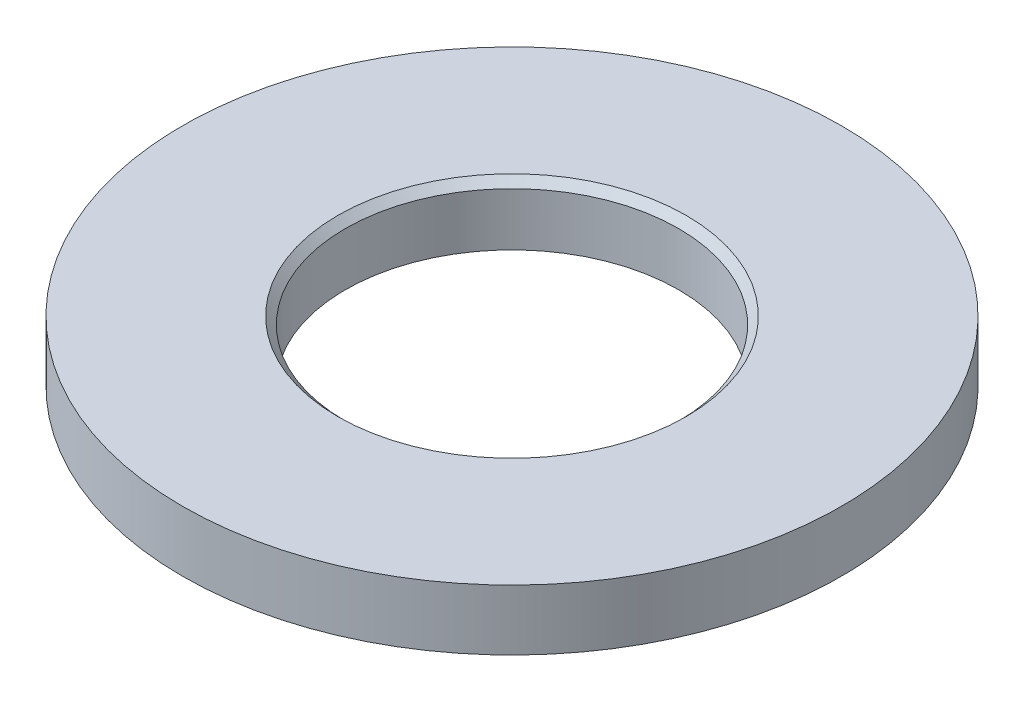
ISO-10303-21;
HEADER;
FILE_DESCRIPTION(('STEP AP214'),'2;1');
FILE_NAME('part.step','',(''),(''),'','','');
FILE_SCHEMA(('AUTOMOTIVE_DESIGN { 1 0 10303 214 1 1 1 1 }'));
ENDSEC;
DATA;
#1=APPLICATION_CONTEXT('core data for automotive mechanical design processes');
#2=APPLICATION_PROTOCOL_DEFINITION('international standard','automotive_design',2000,#1);
#3=PRODUCT_CONTEXT('',#1,'mechanical');
#4=PRODUCT('Part','Part','',(#3));
#5=PRODUCT_RELATED_PRODUCT_CATEGORY('part','',(#4));
#6=PRODUCT_DEFINITION_FORMATION('','',#4);
#7=PRODUCT_DEFINITION_CONTEXT('part definition',#1,'design');
#8=PRODUCT_DEFINITION('design','',#6,#7);
#9=PRODUCT_DEFINITION_SHAPE('','',#8);
#10=(LENGTH_UNIT() NAMED_UNIT(*) SI_UNIT(.MILLI.,.METRE.));
#11=(NAMED_UNIT(*) PLANE_ANGLE_UNIT() SI_UNIT($,.RADIAN.));
#12=(NAMED_UNIT(*) SI_UNIT($,.STERADIAN.) SOLID_ANGLE_UNIT());
#13=UNCERTAINTY_MEASURE_WITH_UNIT(LENGTH_MEASURE(1.E-05),#10,'distance_accuracy_value','');
#14=(GEOMETRIC_REPRESENTATION_CONTEXT(3) GLOBAL_UNCERTAINTY_ASSIGNED_CONTEXT((#13)) GLOBAL_UNIT_ASSIGNED_CONTEXT((#10,
#11,#12)) REPRESENTATION_CONTEXT('',''));
#15=CARTESIAN_POINT('',(0.,0.,0.));
#16=DIRECTION('',(0.,0.,1.));
#17=DIRECTION('',(1.,0.,0.));
#18=AXIS2_PLACEMENT_3D('',#15,#16,#17);
#19=CARTESIAN_POINT('',(0.,0.8,0.));
#20=DIRECTION('',(0.,1.,0.));
#21=DIRECTION('',(0.,0.,1.));
#22=AXIS2_PLACEMENT_3D('',#19,#20,#21);
#23=PLANE('',#22);
#24=CARTESIAN_POINT('',(0.,0.8,0.));
#25=DIRECTION('',(0.,1.,0.));
#26=DIRECTION('',(0.,0.,1.));
#27=AXIS2_PLACEMENT_3D('',#24,#25,#26);
#28=CIRCLE('',#27,2.3);
#29=CARTESIAN_POINT('',(0.,0.8,2.3));
#30=VERTEX_POINT('',#29);
#31=EDGE_CURVE('E10',#30,#30,#28,.F.);
#32=ORIENTED_EDGE('',*,*,#31,.T.);
#33=EDGE_LOOP('',(#32));
#34=FACE_BOUND('',#33,.T.);
#35=CARTESIAN_POINT('',(0.,0.8,0.));
#36=DIRECTION('',(0.,1.,0.));
#37=DIRECTION('',(0.,0.,1.));
#38=AXIS2_PLACEMENT_3D('',#35,#36,#37);
#39=CIRCLE('',#38,4.35);
#40=CARTESIAN_POINT('',(0.,0.8,-4.35));
#41=VERTEX_POINT('',#40);
#42=EDGE_CURVE('E40',#41,#41,#39,.T.);
#43=ORIENTED_EDGE('',*,*,#42,.T.);
#44=EDGE_LOOP('',(#43));
#45=FACE_BOUND('',#44,.T.);
#46=ADVANCED_FACE('F29',(#34,#45),#23,.T.);
#47=CARTESIAN_POINT('',(0.,0.,0.));
#48=DIRECTION('',(0.,1.,0.));
#49=DIRECTION('',(0.,0.,1.));
#50=AXIS2_PLACEMENT_3D('',#47,#48,#49);
#51=PLANE('',#50);
#52=CARTESIAN_POINT('',(0.,0.,0.));
#53=DIRECTION('',(0.,1.,0.));
#54=DIRECTION('',(0.,0.,1.));
#55=AXIS2_PLACEMENT_3D('',#52,#53,#54);
#56=CIRCLE('',#55,4.35);
#57=CARTESIAN_POINT('',(0.,0.,-4.35));
#58=VERTEX_POINT('',#57);
#59=EDGE_CURVE('E44',#58,#58,#56,.T.);
#60=ORIENTED_EDGE('',*,*,#59,.F.);
#61=EDGE_LOOP('',(#60));
#62=FACE_BOUND('',#61,.T.);
#63=CARTESIAN_POINT('',(0.,0.,0.));
#64=DIRECTION('',(0.,1.,0.));
#65=DIRECTION('',(0.,0.,1.));
#66=AXIS2_PLACEMENT_3D('',#63,#64,#65);
#67=CIRCLE('',#66,2.2);
#68=CARTESIAN_POINT('',(0.,0.,-2.2));
#69=VERTEX_POINT('',#68);
#70=EDGE_CURVE('E49',#69,#69,#67,.T.);
#71=ORIENTED_EDGE('',*,*,#70,.T.);
#72=EDGE_LOOP('',(#71));
#73=FACE_BOUND('',#72,.T.);
#74=ADVANCED_FACE('F53',(#62,#73),#51,.F.);
#75=CARTESIAN_POINT('',(0.,0.8,0.));
#76=DIRECTION('',(0.,-1.,0.));
#77=DIRECTION('',(0.,0.,-1.));
#78=AXIS2_PLACEMENT_3D('',#75,#76,#77);
#79=CYLINDRICAL_SURFACE('',#78,4.35);
#80=CARTESIAN_POINT('',(0.,0.8,-4.35));
#81=CARTESIAN_POINT('',(0.,0.791666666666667,-4.35));
#82=CARTESIAN_POINT('',(0.,0.783333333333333,-4.35));
#83=CARTESIAN_POINT('',(0.,0.766666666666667,-4.35));
#84=CARTESIAN_POINT('',(0.,0.758333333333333,-4.35));
#85=CARTESIAN_POINT('',(0.,0.741666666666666,-4.35));
#86=CARTESIAN_POINT('',(0.,0.733333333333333,-4.35));
#87=CARTESIAN_POINT('',(0.,0.716666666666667,-4.35));
#88=CARTESIAN_POINT('',(0.,0.708333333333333,-4.35));
#89=CARTESIAN_POINT('',(0.,0.691666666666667,-4.35));
#90=CARTESIAN_POINT('',(0.,0.683333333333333,-4.35));
#91=CARTESIAN_POINT('',(0.,0.666666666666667,-4.35));
#92=CARTESIAN_POINT('',(0.,0.658333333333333,-4.35));
#93=CARTESIAN_POINT('',(0.,0.641666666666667,-4.35));
#94=CARTESIAN_POINT('',(0.,0.633333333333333,-4.35));
#95=CARTESIAN_POINT('',(0.,0.616666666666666,-4.35));
#96=CARTESIAN_POINT('',(0.,0.608333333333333,-4.35));
#97=CARTESIAN_POINT('',(0.,0.591666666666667,-4.35));
#98=CARTESIAN_POINT('',(0.,0.583333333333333,-4.35));
#99=CARTESIAN_POINT('',(0.,0.566666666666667,-4.35));
#100=CARTESIAN_POINT('',(0.,0.558333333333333,-4.35));
#101=CARTESIAN_POINT('',(0.,0.541666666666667,-4.35));
#102=CARTESIAN_POINT('',(0.,0.533333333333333,-4.35));
#103=CARTESIAN_POINT('',(0.,0.516666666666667,-4.35));
#104=CARTESIAN_POINT('',(0.,0.508333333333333,-4.35));
#105=CARTESIAN_POINT('',(0.,0.491666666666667,-4.35));
#106=CARTESIAN_POINT('',(0.,0.483333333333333,-4.35));
#107=CARTESIAN_POINT('',(0.,0.466666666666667,-4.35));
#108=CARTESIAN_POINT('',(0.,0.458333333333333,-4.35));
#109=CARTESIAN_POINT('',(0.,0.441666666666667,-4.35));
#110=CARTESIAN_POINT('',(0.,0.433333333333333,-4.35));
#111=CARTESIAN_POINT('',(0.,0.416666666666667,-4.35));
#112=CARTESIAN_POINT('',(0.,0.408333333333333,-4.35));
#113=CARTESIAN_POINT('',(0.,0.391666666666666,-4.35));
#114=CARTESIAN_POINT('',(0.,0.383333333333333,-4.35));
#115=CARTESIAN_POINT('',(0.,0.366666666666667,-4.35));
#116=CARTESIAN_POINT('',(0.,0.358333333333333,-4.35));
#117=CARTESIAN_POINT('',(0.,0.341666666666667,-4.35));
#118=CARTESIAN_POINT('',(0.,0.333333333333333,-4.35));
#119=CARTESIAN_POINT('',(0.,0.316666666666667,-4.35));
#120=CARTESIAN_POINT('',(0.,0.308333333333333,-4.35));
#121=CARTESIAN_POINT('',(0.,0.291666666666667,-4.35));
#122=CARTESIAN_POINT('',(0.,0.283333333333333,-4.35));
#123=CARTESIAN_POINT('',(0.,0.266666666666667,-4.35));
#124=CARTESIAN_POINT('',(0.,0.258333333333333,-4.35));
#125=CARTESIAN_POINT('',(0.,0.241666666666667,-4.35));
#126=CARTESIAN_POINT('',(0.,0.233333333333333,-4.35));
#127=CARTESIAN_POINT('',(0.,0.216666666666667,-4.35));
#128=CARTESIAN_POINT('',(0.,0.208333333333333,-4.35));
#129=CARTESIAN_POINT('',(0.,0.191666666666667,-4.35));
#130=CARTESIAN_POINT('',(0.,0.183333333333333,-4.35));
#131=CARTESIAN_POINT('',(0.,0.166666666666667,-4.35));
#132=CARTESIAN_POINT('',(0.,0.158333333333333,-4.35));
#133=CARTESIAN_POINT('',(0.,0.141666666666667,-4.35));
#134=CARTESIAN_POINT('',(0.,0.133333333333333,-4.35));
#135=CARTESIAN_POINT('',(0.,0.116666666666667,-4.35));
#136=CARTESIAN_POINT('',(0.,0.108333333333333,-4.35));
#137=CARTESIAN_POINT('',(0.,0.0916666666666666,-4.35));
#138=CARTESIAN_POINT('',(0.,0.0833333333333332,-4.35));
#139=CARTESIAN_POINT('',(0.,0.0666666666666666,-4.35));
#140=CARTESIAN_POINT('',(0.,0.0583333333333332,-4.35));
#141=CARTESIAN_POINT('',(0.,0.0416666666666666,-4.35));
#142=CARTESIAN_POINT('',(0.,0.0333333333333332,-4.35));
#143=CARTESIAN_POINT('',(0.,0.0166666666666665,-4.35));
#144=CARTESIAN_POINT('',(0.,0.00833333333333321,-4.35));
#145=CARTESIAN_POINT('',(0.,0.,-4.35));
#146=B_SPLINE_CURVE_WITH_KNOTS('',3,(#80,#81,#82,#83,#84,#85,#86,#87,#88,#89,#90,#91,#92,#93,
#94,#95,#96,#97,#98,#99,#100,#101,#102,#103,#104,#105,#106,#107,#108,#109,#110,#111,#112,#113,
#114,#115,#116,#117,#118,#119,#120,#121,#122,#123,#124,#125,#126,#127,#128,#129,#130,#131,#132,
#133,#134,#135,#136,#137,#138,#139,#140,#141,#142,#143,#144,#145),.UNSPECIFIED.,.F.,.F.,(4,2,2,
2,2,2,2,2,2,2,2,2,2,2,2,2,2,2,2,2,2,2,2,2,2,2,2,2,2,2,2,2,4),(0.,0.0250000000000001,0.05,
0.0750000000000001,0.1,0.125,0.15,0.175,0.2,0.225,0.25,0.275,0.3,0.325,0.35,0.375,0.4,0.425,
0.45,0.475,0.5,0.525,0.55,0.575,0.6,0.625,0.65,0.675,0.7,0.725,0.75,0.775,0.8),.UNSPECIFIED.);
#147=EDGE_CURVE('BSEAM31',#41,#58,#146,.T.);
#148=ORIENTED_EDGE('',*,*,#42,.F.);
#149=ORIENTED_EDGE('',*,*,#59,.T.);
#150=ORIENTED_EDGE('',*,*,#147,.T.);
#151=ORIENTED_EDGE('',*,*,#147,.F.);
#152=EDGE_LOOP('',(#148,#150,#149,#151));
#153=FACE_BOUND('',#152,.T.);
#154=ADVANCED_FACE('F31',(#153),#79,.T.);
#155=CARTESIAN_POINT('',(0.,0.8,0.));
#156=DIRECTION('',(0.,-1.,0.));
#157=DIRECTION('',(0.,0.,-1.));
#158=AXIS2_PLACEMENT_3D('',#155,#156,#157);
#159=CYLINDRICAL_SURFACE('',#158,2.2);
#160=CARTESIAN_POINT('',(0.,0.7,0.));
#161=DIRECTION('',(0.,1.,0.));
#162=DIRECTION('',(0.,0.,1.));
#163=AXIS2_PLACEMENT_3D('',#160,#161,#162);
#164=CIRCLE('',#163,2.2);
#165=CARTESIAN_POINT('',(0.,0.7,-2.2));
#166=VERTEX_POINT('',#165);
#167=EDGE_CURVE('E36',#166,#166,#164,.T.);
#168=CARTESIAN_POINT('',(0.,0.7,-2.2));
#169=CARTESIAN_POINT('',(0.,0.692708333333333,-2.2));
#170=CARTESIAN_POINT('',(0.,0.685416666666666,-2.2));
#171=CARTESIAN_POINT('',(0.,0.670833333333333,-2.2));
#172=CARTESIAN_POINT('',(0.,0.663541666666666,-2.2));
#173=CARTESIAN_POINT('',(0.,0.648958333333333,-2.2));
#174=CARTESIAN_POINT('',(0.,0.641666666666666,-2.2));
#175=CARTESIAN_POINT('',(0.,0.627083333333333,-2.2));
#176=CARTESIAN_POINT('',(0.,0.619791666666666,-2.2));
#177=CARTESIAN_POINT('',(0.,0.605208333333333,-2.2));
#178=CARTESIAN_POINT('',(0.,0.597916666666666,-2.2));
#179=CARTESIAN_POINT('',(0.,0.583333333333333,-2.2));
#180=CARTESIAN_POINT('',(0.,0.576041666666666,-2.2));
#181=CARTESIAN_POINT('',(0.,0.561458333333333,-2.2));
#182=CARTESIAN_POINT('',(0.,0.554166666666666,-2.2));
#183=CARTESIAN_POINT('',(0.,0.539583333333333,-2.2));
#184=CARTESIAN_POINT('',(0.,0.532291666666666,-2.2));
#185=CARTESIAN_POINT('',(0.,0.517708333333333,-2.2));
#186=CARTESIAN_POINT('',(0.,0.510416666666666,-2.2));
#187=CARTESIAN_POINT('',(0.,0.495833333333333,-2.2));
#188=CARTESIAN_POINT('',(0.,0.488541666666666,-2.2));
#189=CARTESIAN_POINT('',(0.,0.473958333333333,-2.2));
#190=CARTESIAN_POINT('',(0.,0.466666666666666,-2.2));
#191=CARTESIAN_POINT('',(0.,0.452083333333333,-2.2));
#192=CARTESIAN_POINT('',(0.,0.444791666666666,-2.2));
#193=CARTESIAN_POINT('',(0.,0.430208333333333,-2.2));
#194=CARTESIAN_POINT('',(0.,0.422916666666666,-2.2));
#195=CARTESIAN_POINT('',(0.,0.408333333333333,-2.2));
#196=CARTESIAN_POINT('',(0.,0.401041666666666,-2.2));
#197=CARTESIAN_POINT('',(0.,0.386458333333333,-2.2));
#198=CARTESIAN_POINT('',(0.,0.379166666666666,-2.2));
#199=CARTESIAN_POINT('',(0.,0.364583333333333,-2.2));
#200=CARTESIAN_POINT('',(0.,0.357291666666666,-2.2));
#201=CARTESIAN_POINT('',(0.,0.342708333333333,-2.2));
#202=CARTESIAN_POINT('',(0.,0.335416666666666,-2.2));
#203=CARTESIAN_POINT('',(0.,0.320833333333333,-2.2));
#204=CARTESIAN_POINT('',(0.,0.313541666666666,-2.2));
#205=CARTESIAN_POINT('',(0.,0.298958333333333,-2.2));
#206=CARTESIAN_POINT('',(0.,0.291666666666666,-2.2));
#207=CARTESIAN_POINT('',(0.,0.277083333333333,-2.2));
#208=CARTESIAN_POINT('',(0.,0.269791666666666,-2.2));
#209=CARTESIAN_POINT('',(0.,0.255208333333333,-2.2));
#210=CARTESIAN_POINT('',(0.,0.247916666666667,-2.2));
#211=CARTESIAN_POINT('',(0.,0.233333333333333,-2.2));
#212=CARTESIAN_POINT('',(0.,0.226041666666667,-2.2));
#213=CARTESIAN_POINT('',(0.,0.211458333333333,-2.2));
#214=CARTESIAN_POINT('',(0.,0.204166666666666,-2.2));
#215=CARTESIAN_POINT('',(0.,0.189583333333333,-2.2));
#216=CARTESIAN_POINT('',(0.,0.182291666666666,-2.2));
#217=CARTESIAN_POINT('',(0.,0.167708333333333,-2.2));
#218=CARTESIAN_POINT('',(0.,0.160416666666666,-2.2));
#219=CARTESIAN_POINT('',(0.,0.145833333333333,-2.2));
#220=CARTESIAN_POINT('',(0.,0.138541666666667,-2.2));
#221=CARTESIAN_POINT('',(0.,0.123958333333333,-2.2));
#222=CARTESIAN_POINT('',(0.,0.116666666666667,-2.2));
#223=CARTESIAN_POINT('',(0.,0.102083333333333,-2.2));
#224=CARTESIAN_POINT('',(0.,0.0947916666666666,-2.2));
#225=CARTESIAN_POINT('',(0.,0.0802083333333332,-2.2));
#226=CARTESIAN_POINT('',(0.,0.0729166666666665,-2.2));
#227=CARTESIAN_POINT('',(0.,0.0583333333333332,-2.2));
#228=CARTESIAN_POINT('',(0.,0.0510416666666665,-2.2));
#229=CARTESIAN_POINT('',(0.,0.0364583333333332,-2.2));
#230=CARTESIAN_POINT('',(0.,0.0291666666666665,-2.2));
#231=CARTESIAN_POINT('',(0.,0.0145833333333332,-2.2));
#232=CARTESIAN_POINT('',(0.,0.00729166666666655,-2.2));
#233=CARTESIAN_POINT('',(0.,0.,-2.2));
#234=B_SPLINE_CURVE_WITH_KNOTS('',3,(#168,#169,#170,#171,#172,#173,#174,#175,#176,#177,#178,
#179,#180,#181,#182,#183,#184,#185,#186,#187,#188,#189,#190,#191,#192,#193,#194,#195,#196,#197,
#198,#199,#200,#201,#202,#203,#204,#205,#206,#207,#208,#209,#210,#211,#212,#213,#214,#215,#216,
#217,#218,#219,#220,#221,#222,#223,#224,#225,#226,#227,#228,#229,#230,#231,#232,#233),
.UNSPECIFIED.,.F.,.F.,(4,2,2,2,2,2,2,2,2,2,2,2,2,2,2,2,2,2,2,2,2,2,2,2,2,2,2,2,2,2,2,2,4),(0.,
0.021875,0.04375,0.0656249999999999,0.0874999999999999,0.109375,0.13125,0.153125,0.175,0.196875,
0.21875,0.240625,0.2625,0.284375,0.30625,0.328125,0.35,0.371875,0.39375,0.415625,0.4375,
0.459375,0.48125,0.503125,0.525,0.546875,0.56875,0.590625,0.6125,0.634375,0.65625,0.678125,0.7),.UNSPECIFIED.);
#235=EDGE_CURVE('BSEAM55',#166,#69,#234,.T.);
#236=ORIENTED_EDGE('',*,*,#167,.T.);
#237=ORIENTED_EDGE('',*,*,#70,.F.);
#238=ORIENTED_EDGE('',*,*,#235,.T.);
#239=ORIENTED_EDGE('',*,*,#235,.F.);
#240=EDGE_LOOP('',(#236,#238,#237,#239));
#241=FACE_BOUND('',#240,.T.);
#242=ADVANCED_FACE('F55',(#241),#159,.F.);
#243=CARTESIAN_POINT('',(0.,0.7,0.));
#244=DIRECTION('',(0.,1.,0.));
#245=DIRECTION('',(0.,0.,1.));
#246=AXIS2_PLACEMENT_3D('',#243,#244,#245);
#247=CONICAL_SURFACE('',#246,2.2,0.78539816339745);
#248=ORIENTED_EDGE('',*,*,#31,.F.);
#249=EDGE_LOOP('',(#248));
#250=FACE_BOUND('',#249,.T.);
#251=ORIENTED_EDGE('',*,*,#167,.F.);
#252=EDGE_LOOP('',(#251));
#253=FACE_BOUND('',#252,.T.);
#254=ADVANCED_FACE('F57',(#250,#253),#247,.F.);
#255=CLOSED_SHELL('',(#46,#74,#154,#242,#254));
#256=MANIFOLD_SOLID_BREP('B2',#255);
#257=ADVANCED_BREP_SHAPE_REPRESENTATION('',(#18,#256),#14);
#258=SHAPE_DEFINITION_REPRESENTATION(#9,#257);
ENDSEC;
END-ISO-10303-21;
